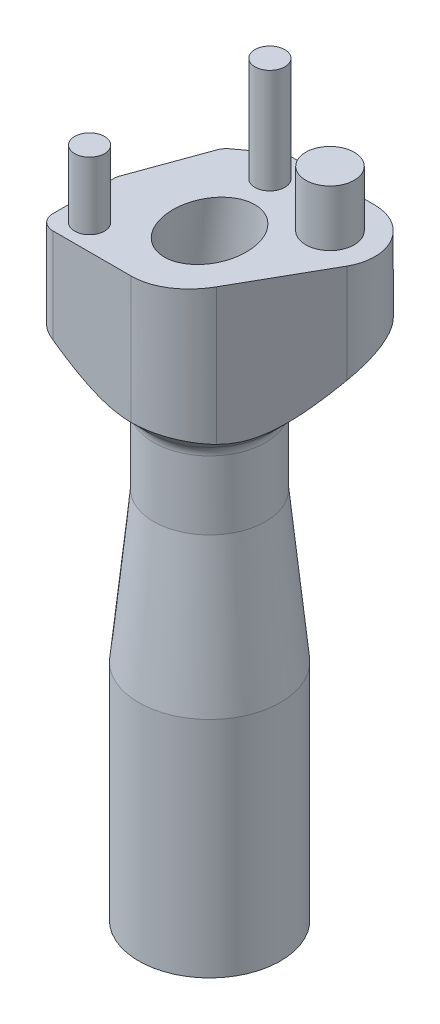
ISO-10303-21;
HEADER;
FILE_DESCRIPTION(('STEP AP214'),'2;1');
FILE_NAME('part.step','',(''),(''),'','','');
FILE_SCHEMA(('AUTOMOTIVE_DESIGN { 1 0 10303 214 1 1 1 1 }'));
ENDSEC;
DATA;
#1=APPLICATION_CONTEXT('core data for automotive mechanical design processes');
#2=APPLICATION_PROTOCOL_DEFINITION('international standard','automotive_design',2000,#1);
#3=PRODUCT_CONTEXT('',#1,'mechanical');
#4=PRODUCT('Part','Part','',(#3));
#5=PRODUCT_RELATED_PRODUCT_CATEGORY('part','',(#4));
#6=PRODUCT_DEFINITION_FORMATION('','',#4);
#7=PRODUCT_DEFINITION_CONTEXT('part definition',#1,'design');
#8=PRODUCT_DEFINITION('design','',#6,#7);
#9=PRODUCT_DEFINITION_SHAPE('','',#8);
#10=(LENGTH_UNIT() NAMED_UNIT(*) SI_UNIT(.MILLI.,.METRE.));
#11=(NAMED_UNIT(*) PLANE_ANGLE_UNIT() SI_UNIT($,.RADIAN.));
#12=(NAMED_UNIT(*) SI_UNIT($,.STERADIAN.) SOLID_ANGLE_UNIT());
#13=UNCERTAINTY_MEASURE_WITH_UNIT(LENGTH_MEASURE(1.E-05),#10,'distance_accuracy_value','');
#14=(GEOMETRIC_REPRESENTATION_CONTEXT(3) GLOBAL_UNCERTAINTY_ASSIGNED_CONTEXT((#13)) GLOBAL_UNIT_ASSIGNED_CONTEXT((#10,
#11,#12)) REPRESENTATION_CONTEXT('',''));
#15=CARTESIAN_POINT('',(0.,0.,0.));
#16=DIRECTION('',(0.,0.,1.));
#17=DIRECTION('',(1.,0.,0.));
#18=AXIS2_PLACEMENT_3D('',#15,#16,#17);
#19=CARTESIAN_POINT('',(-9.,94.,7.07894737));
#20=DIRECTION('',(0.,-1.,0.));
#21=DIRECTION('',(0.,0.,-1.));
#22=AXIS2_PLACEMENT_3D('',#19,#20,#21);
#23=CYLINDRICAL_SURFACE('',#22,2.);
#24=CARTESIAN_POINT('',(-9.,80.,7.07894737));
#25=DIRECTION('',(0.,1.,0.));
#26=DIRECTION('',(0.,0.,1.));
#27=AXIS2_PLACEMENT_3D('',#24,#25,#26);
#28=CIRCLE('',#27,2.);
#29=CARTESIAN_POINT('',(-9.,80.,9.07894737));
#30=VERTEX_POINT('',#29);
#31=EDGE_CURVE('E380',#30,#30,#28,.T.);
#32=ORIENTED_EDGE('',*,*,#31,.T.);
#33=EDGE_LOOP('',(#32));
#34=FACE_BOUND('',#33,.T.);
#35=CARTESIAN_POINT('',(-9.,89.,7.07894737));
#36=DIRECTION('',(0.,1.,0.));
#37=DIRECTION('',(0.,0.,1.));
#38=AXIS2_PLACEMENT_3D('',#35,#36,#37);
#39=CIRCLE('',#38,2.);
#40=CARTESIAN_POINT('',(-9.,89.,9.07894737));
#41=VERTEX_POINT('',#40);
#42=EDGE_CURVE('E13',#41,#41,#39,.T.);
#43=ORIENTED_EDGE('',*,*,#42,.F.);
#44=EDGE_LOOP('',(#43));
#45=FACE_BOUND('',#44,.T.);
#46=ADVANCED_FACE('F55',(#34,#45),#23,.T.);
#47=CARTESIAN_POINT('',(0.,80.,0.));
#48=DIRECTION('',(0.,1.,0.));
#49=DIRECTION('',(0.,0.,1.));
#50=AXIS2_PLACEMENT_3D('',#47,#48,#49);
#51=PLANE('',#50);
#52=CARTESIAN_POINT('',(-2.,80.,-10.07894737));
#53=DIRECTION('',(0.,1.,0.));
#54=DIRECTION('',(0.,0.,1.));
#55=AXIS2_PLACEMENT_3D('',#52,#53,#54);
#56=CIRCLE('',#55,2.);
#57=CARTESIAN_POINT('',(-2.,80.,-8.07894737));
#58=VERTEX_POINT('',#57);
#59=EDGE_CURVE('E678',#58,#58,#56,.T.);
#60=ORIENTED_EDGE('',*,*,#59,.F.);
#61=EDGE_LOOP('',(#60));
#62=FACE_BOUND('',#61,.T.);
#63=DIRECTION('',(0.341408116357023,0.,-0.939915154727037));
#64=VECTOR('',#63,1.);
#65=CARTESIAN_POINT('',(-12.5,80.,0.));
#66=LINE('',#65,#64);
#67=CARTESIAN_POINT('',(-12.3798303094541,80.,-0.330833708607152));
#68=VERTEX_POINT('',#67);
#69=CARTESIAN_POINT('',(-8.8928771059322,80.,-9.93060595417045));
#70=VERTEX_POINT('',#69);
#71=EDGE_CURVE('E166',#68,#70,#66,.T.);
#72=ORIENTED_EDGE('',*,*,#71,.F.);
#73=CARTESIAN_POINT('',(-10.5,80.,0.351982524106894));
#74=DIRECTION('',(0.,1.,0.));
#75=DIRECTION('',(0.,0.,1.));
#76=AXIS2_PLACEMENT_3D('',#73,#74,#75);
#77=CIRCLE('',#76,2.);
#78=CARTESIAN_POINT('',(-12.5,80.,0.351982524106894));
#79=VERTEX_POINT('',#78);
#80=EDGE_CURVE('E610',#68,#79,#77,.T.);
#81=ORIENTED_EDGE('',*,*,#80,.T.);
#82=DIRECTION('',(0.,0.,-1.));
#83=VECTOR('',#82,1.);
#84=CARTESIAN_POINT('',(-12.5,80.,10.5));
#85=LINE('',#84,#83);
#86=CARTESIAN_POINT('',(-12.5,80.,8.49999999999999));
#87=VERTEX_POINT('',#86);
#88=EDGE_CURVE('E171',#87,#79,#85,.T.);
#89=ORIENTED_EDGE('',*,*,#88,.F.);
#90=CARTESIAN_POINT('',(-10.5,80.,8.49999999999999));
#91=DIRECTION('',(0.,1.,0.));
#92=DIRECTION('',(0.,0.,1.));
#93=AXIS2_PLACEMENT_3D('',#90,#91,#92);
#94=CIRCLE('',#93,2.);
#95=CARTESIAN_POINT('',(-10.5,80.,10.5));
#96=VERTEX_POINT('',#95);
#97=EDGE_CURVE('E71',#87,#96,#94,.T.);
#98=ORIENTED_EDGE('',*,*,#97,.T.);
#99=DIRECTION('',(1.,0.,0.));
#100=VECTOR('',#99,1.);
#101=CARTESIAN_POINT('',(-12.5,80.,10.5));
#102=LINE('',#101,#100);
#103=CARTESIAN_POINT('',(0.,80.,10.5));
#104=VERTEX_POINT('',#103);
#105=EDGE_CURVE('E390',#96,#104,#102,.T.);
#106=ORIENTED_EDGE('',*,*,#105,.T.);
#107=CARTESIAN_POINT('',(0.,80.,0.));
#108=DIRECTION('',(0.,1.,0.));
#109=DIRECTION('',(0.,0.,1.));
#110=AXIS2_PLACEMENT_3D('',#107,#108,#109);
#111=ELLIPSE('',#110,10.5,8.5);
#112=CARTESIAN_POINT('',(6.95740145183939,80.,6.03205198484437));
#113=VERTEX_POINT('',#112);
#114=EDGE_CURVE('E387',#104,#113,#111,.T.);
#115=ORIENTED_EDGE('',*,*,#114,.T.);
#116=DIRECTION('',(-0.494000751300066,0.,0.869461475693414));
#117=VECTOR('',#116,1.);
#118=CARTESIAN_POINT('',(13.2842724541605,80.,-5.1034990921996));
#119=LINE('',#118,#117);
#120=CARTESIAN_POINT('',(13.2842724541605,80.,-5.1034990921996));
#121=VERTEX_POINT('',#120);
#122=EDGE_CURVE('E384',#121,#113,#119,.T.);
#123=ORIENTED_EDGE('',*,*,#122,.F.);
#124=CARTESIAN_POINT('',(8.0675036,80.,-8.0675036));
#125=DIRECTION('',(0.,-1.,0.));
#126=DIRECTION('',(0.,0.,-1.));
#127=AXIS2_PLACEMENT_3D('',#124,#125,#126);
#128=CIRCLE('',#127,6.00000000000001);
#129=CARTESIAN_POINT('',(8.06750360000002,80.,-14.0675036));
#130=VERTEX_POINT('',#129);
#131=EDGE_CURVE('E158',#130,#121,#128,.T.);
#132=ORIENTED_EDGE('',*,*,#131,.F.);
#133=DIRECTION('',(-1.,0.,0.));
#134=VECTOR('',#133,1.);
#135=CARTESIAN_POINT('',(8.06750360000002,80.,-14.0675036));
#136=LINE('',#135,#134);
#137=CARTESIAN_POINT('',(-3.83562109,80.,-14.0675036));
#138=VERTEX_POINT('',#137);
#139=EDGE_CURVE('E148',#130,#138,#136,.T.);
#140=ORIENTED_EDGE('',*,*,#139,.T.);
#141=DIRECTION('',(0.80557106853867,0.,-0.592499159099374));
#142=VECTOR('',#141,1.);
#143=CARTESIAN_POINT('',(-8.68605445,80.,-10.5));
#144=LINE('',#143,#142);
#145=CARTESIAN_POINT('',(-8.19804511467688,80.,-10.8589318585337));
#146=VERTEX_POINT('',#145);
#147=EDGE_CURVE('E141',#146,#138,#144,.T.);
#148=ORIENTED_EDGE('',*,*,#147,.F.);
#149=CARTESIAN_POINT('',(-7.01304679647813,80.,-9.2477897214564));
#150=DIRECTION('',(0.,1.,0.));
#151=DIRECTION('',(0.,0.,1.));
#152=AXIS2_PLACEMENT_3D('',#149,#150,#151);
#153=CIRCLE('',#152,2.);
#154=EDGE_CURVE('E607',#146,#70,#153,.T.);
#155=ORIENTED_EDGE('',*,*,#154,.T.);
#156=EDGE_LOOP('',(#72,#81,#89,#98,#106,#115,#123,#132,#140,#148,#155));
#157=FACE_BOUND('',#156,.T.);
#158=CARTESIAN_POINT('',(0.,80.,0.));
#159=DIRECTION('',(0.,1.,0.));
#160=DIRECTION('',(0.,0.,-1.));
#161=AXIS2_PLACEMENT_3D('',#158,#159,#160);
#162=ELLIPSE('',#161,6.07894736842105,4.92105263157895);
#163=CARTESIAN_POINT('',(0.,80.,-6.07894736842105));
#164=VERTEX_POINT('',#163);
#165=EDGE_CURVE('E149',#164,#164,#162,.T.);
#166=ORIENTED_EDGE('',*,*,#165,.F.);
#167=EDGE_LOOP('',(#166));
#168=FACE_BOUND('',#167,.T.);
#169=ORIENTED_EDGE('',*,*,#31,.F.);
#170=EDGE_LOOP('',(#169));
#171=FACE_BOUND('',#170,.T.);
#172=CARTESIAN_POINT('',(8.0675036,80.,-8.0675036));
#173=DIRECTION('',(0.,1.,0.));
#174=DIRECTION('',(0.,0.,1.));
#175=AXIS2_PLACEMENT_3D('',#172,#173,#174);
#176=CIRCLE('',#175,3.25);
#177=CARTESIAN_POINT('',(8.0675036,80.,-4.8175036));
#178=VERTEX_POINT('',#177);
#179=EDGE_CURVE('E679',#178,#178,#176,.T.);
#180=ORIENTED_EDGE('',*,*,#179,.F.);
#181=EDGE_LOOP('',(#180));
#182=FACE_BOUND('',#181,.T.);
#183=ADVANCED_FACE('F154',(#62,#157,#168,#171,#182),#51,.T.);
#184=CARTESIAN_POINT('',(0.,0.,0.));
#185=DIRECTION('',(0.,1.,0.));
#186=DIRECTION('',(0.,0.,1.));
#187=AXIS2_PLACEMENT_3D('',#184,#185,#186);
#188=PLANE('',#187);
#189=CARTESIAN_POINT('',(0.,0.,0.));
#190=DIRECTION('',(0.,1.,0.));
#191=DIRECTION('',(0.,0.,1.));
#192=AXIS2_PLACEMENT_3D('',#189,#190,#191);
#193=CIRCLE('',#192,7.1);
#194=CARTESIAN_POINT('',(0.,0.,7.1));
#195=VERTEX_POINT('',#194);
#196=EDGE_CURVE('E191',#195,#195,#193,.T.);
#197=ORIENTED_EDGE('',*,*,#196,.T.);
#198=EDGE_LOOP('',(#197));
#199=FACE_BOUND('',#198,.T.);
#200=CARTESIAN_POINT('',(0.,0.,0.));
#201=DIRECTION('',(0.,-1.,0.));
#202=DIRECTION('',(0.,0.,-1.));
#203=AXIS2_PLACEMENT_3D('',#200,#201,#202);
#204=CIRCLE('',#203,9.5);
#205=CARTESIAN_POINT('',(0.,0.,-9.5));
#206=VERTEX_POINT('',#205);
#207=EDGE_CURVE('E182',#206,#206,#204,.T.);
#208=ORIENTED_EDGE('',*,*,#207,.T.);
#209=EDGE_LOOP('',(#208));
#210=FACE_BOUND('',#209,.T.);
#211=ADVANCED_FACE('F226',(#199,#210),#188,.F.);
#212=CARTESIAN_POINT('',(0.,30.,0.));
#213=DIRECTION('',(0.,-1.,0.));
#214=DIRECTION('',(0.,0.,-1.));
#215=AXIS2_PLACEMENT_3D('',#212,#213,#214);
#216=CYLINDRICAL_SURFACE('',#215,7.1);
#217=CARTESIAN_POINT('',(0.,30.,0.));
#218=DIRECTION('',(0.,1.,0.));
#219=DIRECTION('',(0.,0.,1.));
#220=AXIS2_PLACEMENT_3D('',#217,#218,#219);
#221=CIRCLE('',#220,7.1);
#222=CARTESIAN_POINT('',(0.,30.,7.1));
#223=VERTEX_POINT('',#222);
#224=EDGE_CURVE('E188',#223,#223,#221,.T.);
#225=ORIENTED_EDGE('',*,*,#224,.T.);
#226=EDGE_LOOP('',(#225));
#227=FACE_BOUND('',#226,.T.);
#228=ORIENTED_EDGE('',*,*,#196,.F.);
#229=EDGE_LOOP('',(#228));
#230=FACE_BOUND('',#229,.T.);
#231=ADVANCED_FACE('F222',(#227,#230),#216,.F.);
#232=CARTESIAN_POINT('',(0.,30.,0.));
#233=DIRECTION('',(0.,1.,0.));
#234=DIRECTION('',(0.,0.,1.));
#235=AXIS2_PLACEMENT_3D('',#232,#233,#234);
#236=PLANE('',#235);
#237=ORIENTED_EDGE('',*,*,#224,.F.);
#238=EDGE_LOOP('',(#237));
#239=FACE_BOUND('',#238,.T.);
#240=CARTESIAN_POINT('',(0.,30.,0.));
#241=DIRECTION('',(0.,1.,0.));
#242=DIRECTION('',(0.,0.,1.));
#243=AXIS2_PLACEMENT_3D('',#240,#241,#242);
#244=CIRCLE('',#243,5.5);
#245=CARTESIAN_POINT('',(0.,30.,5.5));
#246=VERTEX_POINT('',#245);
#247=EDGE_CURVE('E185',#246,#246,#244,.T.);
#248=ORIENTED_EDGE('',*,*,#247,.T.);
#249=EDGE_LOOP('',(#248));
#250=FACE_BOUND('',#249,.T.);
#251=ADVANCED_FACE('F217',(#239,#250),#236,.F.);
#252=CARTESIAN_POINT('',(0.,50.,0.));
#253=DIRECTION('',(0.,-1.,0.));
#254=DIRECTION('',(0.,0.,-1.));
#255=AXIS2_PLACEMENT_3D('',#252,#253,#254);
#256=CYLINDRICAL_SURFACE('',#255,5.5);
#257=ORIENTED_EDGE('',*,*,#247,.F.);
#258=EDGE_LOOP('',(#257));
#259=FACE_BOUND('',#258,.T.);
#260=CARTESIAN_POINT('',(0.,70.,0.));
#261=DIRECTION('',(0.,-1.,0.));
#262=DIRECTION('',(0.,0.,-1.));
#263=AXIS2_PLACEMENT_3D('',#260,#261,#262);
#264=CIRCLE('',#263,5.5);
#265=CARTESIAN_POINT('',(0.,70.,-5.5));
#266=VERTEX_POINT('',#265);
#267=EDGE_CURVE('E199',#266,#266,#264,.T.);
#268=ORIENTED_EDGE('',*,*,#267,.F.);
#269=EDGE_LOOP('',(#268));
#270=FACE_BOUND('',#269,.T.);
#271=ADVANCED_FACE('F206',(#259,#270),#256,.F.);
#272=CARTESIAN_POINT('',(0.,30.,0.));
#273=DIRECTION('',(0.,-1.,0.));
#274=DIRECTION('',(0.,0.,-1.));
#275=AXIS2_PLACEMENT_3D('',#272,#273,#274);
#276=CYLINDRICAL_SURFACE('',#275,9.5);
#277=CARTESIAN_POINT('',(0.,30.,0.));
#278=DIRECTION('',(0.,-1.,0.));
#279=DIRECTION('',(0.,0.,-1.));
#280=AXIS2_PLACEMENT_3D('',#277,#278,#279);
#281=CIRCLE('',#280,9.5);
#282=CARTESIAN_POINT('',(0.,30.,-9.5));
#283=VERTEX_POINT('',#282);
#284=EDGE_CURVE('E178',#283,#283,#281,.T.);
#285=ORIENTED_EDGE('',*,*,#284,.T.);
#286=EDGE_LOOP('',(#285));
#287=FACE_BOUND('',#286,.T.);
#288=ORIENTED_EDGE('',*,*,#207,.F.);
#289=EDGE_LOOP('',(#288));
#290=FACE_BOUND('',#289,.T.);
#291=ADVANCED_FACE('F216',(#287,#290),#276,.T.);
#292=CARTESIAN_POINT('',(0.,30.,0.));
#293=DIRECTION('',(0.,-1.,0.));
#294=DIRECTION('',(0.,0.,-1.));
#295=AXIS2_PLACEMENT_3D('',#292,#293,#294);
#296=CONICAL_SURFACE('',#295,9.5,0.099668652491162);
#297=ORIENTED_EDGE('',*,*,#284,.F.);
#298=EDGE_LOOP('',(#297));
#299=FACE_BOUND('',#298,.T.);
#300=CARTESIAN_POINT('',(0.,50.,0.));
#301=DIRECTION('',(0.,1.,0.));
#302=DIRECTION('',(0.,0.,1.));
#303=AXIS2_PLACEMENT_3D('',#300,#301,#302);
#304=CIRCLE('',#303,7.5);
#305=CARTESIAN_POINT('',(0.,50.,7.5));
#306=VERTEX_POINT('',#305);
#307=EDGE_CURVE('E175',#306,#306,#304,.T.);
#308=ORIENTED_EDGE('',*,*,#307,.F.);
#309=EDGE_LOOP('',(#308));
#310=FACE_BOUND('',#309,.T.);
#311=ADVANCED_FACE('F414',(#299,#310),#296,.T.);
#312=CARTESIAN_POINT('',(0.,70.,0.));
#313=DIRECTION('',(0.,-1.,0.));
#314=DIRECTION('',(0.,0.,-1.));
#315=AXIS2_PLACEMENT_3D('',#312,#313,#314);
#316=CYLINDRICAL_SURFACE('',#315,7.5);
#317=CARTESIAN_POINT('',(0.,59.1715728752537,0.));
#318=DIRECTION('',(0.,-1.,0.));
#319=DIRECTION('',(0.,0.,-1.));
#320=AXIS2_PLACEMENT_3D('',#317,#318,#319);
#321=CIRCLE('',#320,7.5);
#322=CARTESIAN_POINT('',(0.,59.1715728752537,-7.5));
#323=VERTEX_POINT('',#322);
#324=EDGE_CURVE('E624',#323,#323,#321,.T.);
#325=ORIENTED_EDGE('',*,*,#324,.T.);
#326=EDGE_LOOP('',(#325));
#327=FACE_BOUND('',#326,.T.);
#328=ORIENTED_EDGE('',*,*,#307,.T.);
#329=EDGE_LOOP('',(#328));
#330=FACE_BOUND('',#329,.T.);
#331=ADVANCED_FACE('F408',(#327,#330),#316,.T.);
#332=CARTESIAN_POINT('',(8.06750360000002,80.,-14.0675036));
#333=DIRECTION('',(0.,0.,1.));
#334=DIRECTION('',(1.,0.,0.));
#335=AXIS2_PLACEMENT_3D('',#332,#333,#334);
#336=PLANE('',#335);
#337=DIRECTION('',(0.,-1.,0.));
#338=VECTOR('',#337,1.);
#339=CARTESIAN_POINT('',(8.06750360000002,80.,-14.0675036));
#340=LINE('',#339,#338);
#341=CARTESIAN_POINT('',(8.06750360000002,68.716635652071,-14.0675036));
#342=VERTEX_POINT('',#341);
#343=EDGE_CURVE('E165',#130,#342,#340,.T.);
#344=ORIENTED_EDGE('',*,*,#343,.T.);
#345=CARTESIAN_POINT('',(8.06750360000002,68.716635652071,-14.0675036));
#346=CARTESIAN_POINT('',(7.785797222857,68.5765159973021,-14.0675036));
#347=CARTESIAN_POINT('',(7.50185938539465,68.4407617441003,-14.0675036));
#348=CARTESIAN_POINT('',(6.9291714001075,68.1793786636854,-14.0675036));
#349=CARTESIAN_POINT('',(6.64041856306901,68.0537557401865,-14.0675036));
#350=CARTESIAN_POINT('',(6.05636091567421,67.813489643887,-14.0675036));
#351=CARTESIAN_POINT('',(5.76102752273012,67.6989155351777,-14.0675036));
#352=CARTESIAN_POINT('',(5.16548699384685,67.4833201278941,-14.0675036));
#353=CARTESIAN_POINT('',(4.86528072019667,67.3822964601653,-14.0675036));
#354=CARTESIAN_POINT('',(4.27355314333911,67.1997377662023,-14.0675036));
#355=CARTESIAN_POINT('',(3.98223845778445,67.1175363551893,-14.0675036));
#356=CARTESIAN_POINT('',(3.39565587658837,66.9687482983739,-14.0675036));
#357=CARTESIAN_POINT('',(3.10038840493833,66.902159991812,-14.0675036));
#358=CARTESIAN_POINT('',(2.50721779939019,66.786232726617,-14.0675036));
#359=CARTESIAN_POINT('',(2.20932299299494,66.736851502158,-14.0675036));
#360=CARTESIAN_POINT('',(1.61111974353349,66.6563591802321,-14.0675036));
#361=CARTESIAN_POINT('',(1.31081170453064,66.6252450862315,-14.0675036));
#362=CARTESIAN_POINT('',(0.60936977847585,66.5750389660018,-14.0675036));
#363=CARTESIAN_POINT('',(0.207684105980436,66.5633082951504,-14.0675036));
#364=CARTESIAN_POINT('',(-0.595522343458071,66.5743719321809,-14.0675036));
#365=CARTESIAN_POINT('',(-0.997042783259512,66.5971915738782,-14.0675036));
#366=CARTESIAN_POINT('',(-1.6027227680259,66.6570205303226,-14.0675036));
#367=CARTESIAN_POINT('',(-1.80817264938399,66.6817834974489,-14.0675036));
#368=CARTESIAN_POINT('',(-2.21788948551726,66.7398245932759,-14.0675036));
#369=CARTESIAN_POINT('',(-2.42215636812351,66.7731032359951,-14.0675036));
#370=CARTESIAN_POINT('',(-2.82898861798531,66.8477484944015,-14.0675036));
#371=CARTESIAN_POINT('',(-3.03155545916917,66.8891071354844,-14.0675036));
#372=CARTESIAN_POINT('',(-3.4349416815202,66.9794608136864,-14.0675036));
#373=CARTESIAN_POINT('',(-3.63576138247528,67.0284544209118,-14.0675036));
#374=CARTESIAN_POINT('',(-3.83562109,67.0810372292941,-14.0675036));
#375=B_SPLINE_CURVE_WITH_KNOTS('',3,(#345,#346,#347,#348,#349,#350,#351,#352,#353,#354,#355,
#356,#357,#358,#359,#360,#361,#362,#363,#364,#365,#366,#367,#368,#369,#370,#371,#372,#373,#374),
.UNSPECIFIED.,.F.,.F.,(4,2,2,2,2,2,2,2,2,2,2,2,2,2,4),(0.,0.943931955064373,1.88841004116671,
2.83845377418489,3.78833118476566,4.69601207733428,5.60359637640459,6.50893539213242,
7.41412585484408,8.61818895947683,9.82313536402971,10.4437953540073,11.0644928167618,
11.684580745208,12.3045526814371),.UNSPECIFIED.);
#376=CARTESIAN_POINT('',(-3.83562109,67.0810372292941,-14.0675036));
#377=VERTEX_POINT('',#376);
#378=EDGE_CURVE('E163',#342,#377,#375,.T.);
#379=ORIENTED_EDGE('',*,*,#378,.T.);
#380=DIRECTION('',(0.,-1.,0.));
#381=VECTOR('',#380,1.);
#382=CARTESIAN_POINT('',(-3.83562109,80.,-14.0675036));
#383=LINE('',#382,#381);
#384=EDGE_CURVE('E145',#138,#377,#383,.T.);
#385=ORIENTED_EDGE('',*,*,#384,.F.);
#386=ORIENTED_EDGE('',*,*,#139,.F.);
#387=EDGE_LOOP('',(#344,#379,#385,#386));
#388=FACE_BOUND('',#387,.T.);
#389=ADVANCED_FACE('F161',(#388),#336,.F.);
#390=CARTESIAN_POINT('',(8.0675036,80.,-8.0675036));
#391=DIRECTION('',(0.,-1.,0.));
#392=DIRECTION('',(0.,0.,-1.));
#393=AXIS2_PLACEMENT_3D('',#390,#391,#392);
#394=CYLINDRICAL_SURFACE('',#393,6.00000000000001);
#395=DIRECTION('',(0.,-1.,0.));
#396=VECTOR('',#395,1.);
#397=CARTESIAN_POINT('',(13.2842724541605,80.,-5.1034990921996));
#398=LINE('',#397,#396);
#399=CARTESIAN_POINT('',(13.2842724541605,66.7308677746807,-5.1034990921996));
#400=VERTEX_POINT('',#399);
#401=EDGE_CURVE('E168',#121,#400,#398,.T.);
#402=ORIENTED_EDGE('',*,*,#401,.T.);
#403=CARTESIAN_POINT('',(13.2842724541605,66.7308677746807,-5.1034990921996));
#404=CARTESIAN_POINT('',(13.3838448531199,66.8866751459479,-5.2787313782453));
#405=CARTESIAN_POINT('',(13.4757601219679,67.039582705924,-5.46108990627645));
#406=CARTESIAN_POINT('',(13.6422847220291,67.3387879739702,-5.83936620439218));
#407=CARTESIAN_POINT('',(13.716856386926,67.4850707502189,-6.0353123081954));
#408=CARTESIAN_POINT('',(13.8466361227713,67.7703742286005,-6.44049756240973));
#409=CARTESIAN_POINT('',(13.9017274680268,67.9093470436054,-6.64980825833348));
#410=CARTESIAN_POINT('',(13.9895352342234,68.1776104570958,-7.07886216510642));
#411=CARTESIAN_POINT('',(14.022274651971,68.3069108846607,-7.29859440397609));
#412=CARTESIAN_POINT('',(14.0566195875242,68.5149676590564,-7.67508996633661));
#413=CARTESIAN_POINT('',(14.0648187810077,68.5967098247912,-7.82962857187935));
#414=CARTESIAN_POINT('',(14.0690726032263,68.754493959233,-8.14173773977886));
#415=CARTESIAN_POINT('',(14.0651303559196,68.8305373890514,-8.29930751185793));
#416=CARTESIAN_POINT('',(14.044470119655,68.9762093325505,-8.61615853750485));
#417=CARTESIAN_POINT('',(14.0277799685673,69.0458514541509,-8.7754353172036));
#418=CARTESIAN_POINT('',(13.9811034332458,69.1782865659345,-9.09481363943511));
#419=CARTESIAN_POINT('',(13.9511235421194,69.2410828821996,-9.25491474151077));
#420=CARTESIAN_POINT('',(13.8771045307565,69.3597847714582,-9.57612429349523));
#421=CARTESIAN_POINT('',(13.8329437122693,69.4156246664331,-9.73722916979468));
#422=CARTESIAN_POINT('',(13.7303954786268,69.5191237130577,-10.0574539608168));
#423=CARTESIAN_POINT('',(13.6720150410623,69.5667868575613,-10.2165748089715));
#424=CARTESIAN_POINT('',(13.5409515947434,69.6533981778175,-10.5313289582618));
#425=CARTESIAN_POINT('',(13.4682648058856,69.6923440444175,-10.6869613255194));
#426=CARTESIAN_POINT('',(13.3088212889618,69.7609817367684,-10.9929675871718));
#427=CARTESIAN_POINT('',(13.2220667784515,69.7906750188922,-11.1433423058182));
#428=CARTESIAN_POINT('',(13.0467864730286,69.8372607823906,-11.41861135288));
#429=CARTESIAN_POINT('',(12.9598558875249,69.8552935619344,-11.5443316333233));
#430=CARTESIAN_POINT('',(12.7761862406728,69.8837625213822,-11.7892954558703));
#431=CARTESIAN_POINT('',(12.6794481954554,69.8941994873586,-11.9085396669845));
#432=CARTESIAN_POINT('',(12.4769282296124,69.907350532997,-12.139425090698));
#433=CARTESIAN_POINT('',(12.3711511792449,69.9100687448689,-12.2510703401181));
#434=CARTESIAN_POINT('',(12.1513774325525,69.9077612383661,-12.4658646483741));
#435=CARTESIAN_POINT('',(12.0373810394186,69.902735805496,-12.5690140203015));
#436=CARTESIAN_POINT('',(11.8111576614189,69.8856809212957,-12.758466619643));
#437=CARTESIAN_POINT('',(11.6994600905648,69.8742155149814,-12.8454547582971));
#438=CARTESIAN_POINT('',(11.4707252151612,69.8448428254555,-13.0109859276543));
#439=CARTESIAN_POINT('',(11.3536862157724,69.8269334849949,-13.0895262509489));
#440=CARTESIAN_POINT('',(11.1152525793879,69.7848564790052,-13.2376990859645));
#441=CARTESIAN_POINT('',(10.9938597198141,69.7606913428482,-13.3073351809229));
#442=CARTESIAN_POINT('',(10.7475421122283,69.7063143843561,-13.4374947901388));
#443=CARTESIAN_POINT('',(10.622616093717,69.6761003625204,-13.4980149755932));
#444=CARTESIAN_POINT('',(10.3674607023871,69.6091833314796,-13.6109754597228));
#445=CARTESIAN_POINT('',(10.2371750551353,69.5723547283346,-13.6632139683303));
#446=CARTESIAN_POINT('',(9.97478060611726,69.4929677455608,-13.7580012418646));
#447=CARTESIAN_POINT('',(9.84267106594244,69.4504069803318,-13.8005459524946));
#448=CARTESIAN_POINT('',(9.57757933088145,69.3599089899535,-13.8760026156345));
#449=CARTESIAN_POINT('',(9.44459727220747,69.3119725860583,-13.9089160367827));
#450=CARTESIAN_POINT('',(9.17853875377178,69.2110578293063,-13.9653081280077));
#451=CARTESIAN_POINT('',(9.04546228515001,69.1580789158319,-13.9887857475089));
#452=CARTESIAN_POINT('',(8.77035186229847,69.0434192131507,-14.0279292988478));
#453=CARTESIAN_POINT('',(8.62836726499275,68.9813860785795,-14.0429062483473));
#454=CARTESIAN_POINT('',(8.34636849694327,68.8525270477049,-14.0626838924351));
#455=CARTESIAN_POINT('',(8.20634978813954,68.7857156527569,-14.0675141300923));
#456=CARTESIAN_POINT('',(8.06750360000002,68.716635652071,-14.0675036));
#457=B_SPLINE_CURVE_WITH_KNOTS('',3,(#403,#404,#405,#406,#407,#408,#409,#410,#411,#412,#413,
#414,#415,#416,#417,#418,#419,#420,#421,#422,#423,#424,#425,#426,#427,#428,#429,#430,#431,#432,
#433,#434,#435,#436,#437,#438,#439,#440,#441,#442,#443,#444,#445,#446,#447,#448,#449,#450,#451,
#452,#453,#454,#455,#456),.UNSPECIFIED.,.F.,.F.,(4,2,2,2,2,2,2,2,2,2,2,2,2,2,2,2,2,2,2,2,2,2,2,
2,2,2,4),(0.,0.76422269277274,1.53008991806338,2.30047139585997,3.07005906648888,
3.59463119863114,4.11906837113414,4.64236358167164,5.16540340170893,5.69305751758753,
6.22045323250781,6.74798848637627,7.27544066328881,7.73655195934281,8.19761552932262,
8.65843222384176,9.11923192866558,9.54484997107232,9.97060401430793,10.3961861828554,
10.821923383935,11.2568178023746,11.6918937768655,12.1269033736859,12.5619613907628,
13.0285312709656,13.4937407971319),.UNSPECIFIED.);
#458=EDGE_CURVE('E264',#400,#342,#457,.T.);
#459=ORIENTED_EDGE('',*,*,#458,.T.);
#460=ORIENTED_EDGE('',*,*,#343,.F.);
#461=ORIENTED_EDGE('',*,*,#131,.T.);
#462=EDGE_LOOP('',(#402,#459,#460,#461));
#463=FACE_BOUND('',#462,.T.);
#464=ADVANCED_FACE('F401',(#463),#394,.T.);
#465=CARTESIAN_POINT('',(13.2842724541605,80.,-5.1034990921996));
#466=DIRECTION('',(0.869461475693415,0.,0.494000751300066));
#467=DIRECTION('',(0.494000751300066,0.,-0.869461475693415));
#468=AXIS2_PLACEMENT_3D('',#465,#466,#467);
#469=PLANE('',#468);
#470=DIRECTION('',(0.,-1.,0.));
#471=VECTOR('',#470,1.);
#472=CARTESIAN_POINT('',(6.95740145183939,80.,6.03205198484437));
#473=LINE('',#472,#471);
#474=CARTESIAN_POINT('',(6.95740145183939,61.7082075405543,6.03205198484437));
#475=VERTEX_POINT('',#474);
#476=EDGE_CURVE('E639',#113,#475,#473,.T.);
#477=ORIENTED_EDGE('',*,*,#476,.T.);
#478=CARTESIAN_POINT('',(6.95740145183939,61.7082075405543,6.03205198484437));
#479=CARTESIAN_POINT('',(7.01313025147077,61.6860589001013,5.93396702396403));
#480=CARTESIAN_POINT('',(7.06904278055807,61.665836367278,5.83555869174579));
#481=CARTESIAN_POINT('',(7.18119055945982,61.6294005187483,5.63817402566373));
#482=CARTESIAN_POINT('',(7.23742583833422,61.6131875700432,5.5391976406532));
#483=CARTESIAN_POINT('',(7.40651299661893,61.5708093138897,5.24159734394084));
#484=CARTESIAN_POINT('',(7.51976633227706,61.5508964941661,5.04226685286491));
#485=CARTESIAN_POINT('',(7.74475125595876,61.5287468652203,4.64628420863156));
#486=CARTESIAN_POINT('',(7.85647584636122,61.5262143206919,4.44964437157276));
#487=CARTESIAN_POINT('',(8.07969251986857,61.5381321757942,4.05677391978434));
#488=CARTESIAN_POINT('',(8.19118462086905,61.5525812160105,3.86054327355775));
#489=CARTESIAN_POINT('',(8.42937575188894,61.6011830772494,3.44131716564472));
#490=CARTESIAN_POINT('',(8.55594835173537,61.6378775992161,3.21854422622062));
#491=CARTESIAN_POINT('',(8.80730439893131,61.7310873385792,2.77614732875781));
#492=CARTESIAN_POINT('',(8.93208738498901,61.7876075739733,2.55652418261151));
#493=CARTESIAN_POINT('',(9.1809115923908,61.9190049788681,2.11858342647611));
#494=CARTESIAN_POINT('',(9.30492415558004,61.9941022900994,1.9003162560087));
#495=CARTESIAN_POINT('',(9.55034796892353,62.1597294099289,1.46836033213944));
#496=CARTESIAN_POINT('',(9.67175980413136,62.2502557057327,1.2546705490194));
#497=CARTESIAN_POINT('',(9.95476300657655,62.4788891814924,0.756573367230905));
#498=CARTESIAN_POINT('',(10.1152729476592,62.6224629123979,0.474069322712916));
#499=CARTESIAN_POINT('',(10.4318921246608,62.9284197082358,-0.0831933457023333));
#500=CARTESIAN_POINT('',(10.5879990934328,63.0908122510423,-0.357947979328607));
#501=CARTESIAN_POINT('',(10.8967438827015,63.4308051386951,-0.901351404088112));
#502=CARTESIAN_POINT('',(11.0493688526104,63.608452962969,-1.16997757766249));
#503=CARTESIAN_POINT('',(11.3511352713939,63.9752948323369,-1.70109878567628));
#504=CARTESIAN_POINT('',(11.5002773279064,64.1644868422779,-1.96359488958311));
#505=CARTESIAN_POINT('',(11.7892857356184,64.5437495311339,-2.4722614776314));
#506=CARTESIAN_POINT('',(11.9292758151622,64.7334357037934,-2.71864972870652));
#507=CARTESIAN_POINT('',(12.2069486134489,65.1196321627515,-3.20736518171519));
#508=CARTESIAN_POINT('',(12.3446311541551,65.3161429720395,-3.44969207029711));
#509=CARTESIAN_POINT('',(12.616939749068,65.7131601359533,-3.92896630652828));
#510=CARTESIAN_POINT('',(12.7515813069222,65.9136230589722,-4.16594094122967));
#511=CARTESIAN_POINT('',(13.0191429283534,66.3190693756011,-4.63686031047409));
#512=CARTESIAN_POINT('',(13.1520634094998,66.5240516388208,-4.87080577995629));
#513=CARTESIAN_POINT('',(13.2842724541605,66.7308677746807,-5.10349909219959));
#514=B_SPLINE_CURVE_WITH_KNOTS('',3,(#478,#479,#480,#481,#482,#483,#484,#485,#486,#487,#488,
#489,#490,#491,#492,#493,#494,#495,#496,#497,#498,#499,#500,#501,#502,#503,#504,#505,#506,#507,
#508,#509,#510,#511,#512,#513),.UNSPECIFIED.,.F.,.F.,(4,2,2,2,2,2,2,2,2,2,2,2,2,2,2,2,2,4),(0.,
0.344862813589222,0.689757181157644,1.37942154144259,2.05732111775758,2.73516643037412,
3.51079472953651,4.28661948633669,5.07211968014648,5.85744127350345,6.9223049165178,
7.98770721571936,9.05655471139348,10.1252143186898,11.148114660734,12.1710935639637,
13.1860482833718,14.2007519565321),.UNSPECIFIED.);
#515=EDGE_CURVE('E257',#475,#400,#514,.T.);
#516=ORIENTED_EDGE('',*,*,#515,.T.);
#517=ORIENTED_EDGE('',*,*,#401,.F.);
#518=ORIENTED_EDGE('',*,*,#122,.T.);
#519=EDGE_LOOP('',(#477,#516,#517,#518));
#520=FACE_BOUND('',#519,.T.);
#521=ADVANCED_FACE('F396',(#520),#469,.T.);
#522=DIRECTION('',(0.,-1.,0.));
#523=VECTOR('',#522,1.);
#524=SURFACE_OF_LINEAR_EXTRUSION('',#111,#523);
#525=DIRECTION('',(0.,-1.,0.));
#526=VECTOR('',#525,1.);
#527=CARTESIAN_POINT('',(0.,80.,10.5));
#528=LINE('',#527,#526);
#529=CARTESIAN_POINT('',(0.,62.9999999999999,10.5));
#530=VERTEX_POINT('',#529);
#531=EDGE_CURVE('E179',#104,#530,#528,.T.);
#532=ORIENTED_EDGE('',*,*,#531,.T.);
#533=CARTESIAN_POINT('',(0.,62.9999999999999,10.5));
#534=CARTESIAN_POINT('',(0.0964544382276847,63.0000008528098,10.5000012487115));
#535=CARTESIAN_POINT('',(0.192895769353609,62.9993007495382,10.4979714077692));
#536=CARTESIAN_POINT('',(0.385583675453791,62.9965082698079,10.4898669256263));
#537=CARTESIAN_POINT('',(0.481830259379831,62.9944159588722,10.4837924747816));
#538=CARTESIAN_POINT('',(0.769888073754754,62.9860694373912,10.4595406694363));
#539=CARTESIAN_POINT('',(0.961169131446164,62.9777456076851,10.4353348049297));
#540=CARTESIAN_POINT('',(1.33944277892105,62.9558693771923,10.371477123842));
#541=CARTESIAN_POINT('',(1.52645574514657,62.9423531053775,10.3319320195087));
#542=CARTESIAN_POINT('',(1.89630959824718,62.9104238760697,10.2380214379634));
#543=CARTESIAN_POINT('',(2.07915006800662,62.892010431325,10.1836544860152));
#544=CARTESIAN_POINT('',(2.43911910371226,62.8507672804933,10.0610502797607));
#545=CARTESIAN_POINT('',(2.61625971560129,62.8279477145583,9.99284485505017));
#546=CARTESIAN_POINT('',(2.96442770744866,62.7783553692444,9.8433759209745));
#547=CARTESIAN_POINT('',(3.13545290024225,62.7515811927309,9.76210779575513));
#548=CARTESIAN_POINT('',(3.47091126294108,62.69457603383,9.58734434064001));
#549=CARTESIAN_POINT('',(3.63533241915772,62.6643391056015,9.49382793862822));
#550=CARTESIAN_POINT('',(3.95675310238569,62.6010076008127,9.29565088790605));
#551=CARTESIAN_POINT('',(4.11375105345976,62.567912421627,9.19098788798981));
#552=CARTESIAN_POINT('',(4.47657001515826,62.4867621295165,8.9308505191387));
#553=CARTESIAN_POINT('',(4.67897679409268,62.4377005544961,8.77089867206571));
#554=CARTESIAN_POINT('',(5.06847342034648,62.3367242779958,8.43419045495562));
#555=CARTESIAN_POINT('',(5.25555670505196,62.2848083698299,8.25742695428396));
#556=CARTESIAN_POINT('',(5.79336214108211,62.126841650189,7.70491612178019));
#557=CARTESIAN_POINT('',(6.12094316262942,62.0185002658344,7.30672590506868));
#558=CARTESIAN_POINT('',(6.51360456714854,61.8777192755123,6.7484786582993));
#559=CARTESIAN_POINT('',(6.60726628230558,61.8431552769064,6.60802650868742));
#560=CARTESIAN_POINT('',(6.78750741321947,61.7749485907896,6.32309216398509));
#561=CARTESIAN_POINT('',(6.87410875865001,61.7413032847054,6.17862447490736));
#562=CARTESIAN_POINT('',(6.95740145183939,61.7082075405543,6.03205198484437));
#563=B_SPLINE_CURVE_WITH_KNOTS('',3,(#533,#534,#535,#536,#537,#538,#539,#540,#541,#542,#543,
#544,#545,#546,#547,#548,#549,#550,#551,#552,#553,#554,#555,#556,#557,#558,#559,#560,#561,#562),
.UNSPECIFIED.,.F.,.F.,(4,2,2,2,2,2,2,2,2,2,2,2,2,2,4),(0.,0.289313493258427,0.578613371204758,
1.15675945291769,1.73095360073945,2.30520490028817,2.87815005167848,3.45129810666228,
4.02544549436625,4.59971423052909,5.38634079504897,6.17330250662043,7.7460907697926,
8.26295074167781,8.77813878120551),.UNSPECIFIED.);
#564=EDGE_CURVE('E250',#530,#475,#563,.T.);
#565=ORIENTED_EDGE('',*,*,#564,.T.);
#566=ORIENTED_EDGE('',*,*,#476,.F.);
#567=ORIENTED_EDGE('',*,*,#114,.F.);
#568=EDGE_LOOP('',(#532,#565,#566,#567));
#569=FACE_BOUND('',#568,.T.);
#570=ADVANCED_FACE('F392',(#569),#524,.F.);
#571=CARTESIAN_POINT('',(-12.5,80.,10.5));
#572=DIRECTION('',(0.,0.,-1.));
#573=DIRECTION('',(-1.,0.,0.));
#574=AXIS2_PLACEMENT_3D('',#571,#572,#573);
#575=PLANE('',#574);
#576=ORIENTED_EDGE('',*,*,#105,.F.);
#577=DIRECTION('',(0.,-1.,0.));
#578=VECTOR('',#577,1.);
#579=CARTESIAN_POINT('',(-10.5,68.8248277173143,10.5));
#580=LINE('',#579,#578);
#581=CARTESIAN_POINT('',(-10.5,67.3492424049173,10.5));
#582=VERTEX_POINT('',#581);
#583=EDGE_CURVE('E64',#96,#582,#580,.T.);
#584=ORIENTED_EDGE('',*,*,#583,.T.);
#585=CARTESIAN_POINT('',(-12.5,68.8248277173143,10.5));
#586=CARTESIAN_POINT('',(-12.2681126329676,68.6472874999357,10.5));
#587=CARTESIAN_POINT('',(-12.0352494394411,68.471010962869,10.5));
#588=CARTESIAN_POINT('',(-11.5673058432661,68.1214029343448,10.5));
#589=CARTESIAN_POINT('',(-11.332225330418,67.948071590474,10.5));
#590=CARTESIAN_POINT('',(-10.859970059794,67.6050548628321,10.5));
#591=CARTESIAN_POINT('',(-10.6227991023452,67.435364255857,10.5));
#592=CARTESIAN_POINT('',(-10.1457072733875,67.0998834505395,10.5));
#593=CARTESIAN_POINT('',(-9.90578637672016,66.9340932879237,10.5));
#594=CARTESIAN_POINT('',(-9.42270138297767,66.6069375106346,10.5));
#595=CARTESIAN_POINT('',(-9.17953518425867,66.4455749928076,10.5));
#596=CARTESIAN_POINT('',(-8.6897661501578,66.1281793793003,10.5));
#597=CARTESIAN_POINT('',(-8.44316354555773,65.9721459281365,10.5));
#598=CARTESIAN_POINT('',(-7.94572532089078,65.6660912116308,10.5));
#599=CARTESIAN_POINT('',(-7.69488387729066,65.5160793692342,10.5));
#600=CARTESIAN_POINT('',(-7.18883191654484,65.2234815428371,10.5));
#601=CARTESIAN_POINT('',(-6.93362034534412,65.0808973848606,10.5));
#602=CARTESIAN_POINT('',(-6.67603529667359,64.9426463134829,10.5));
#603=B_SPLINE_CURVE_WITH_KNOTS('',3,(#585,#586,#587,#588,#589,#590,#591,#592,#593,#594,#595,
#596,#597,#598,#599,#600,#601,#602),.UNSPECIFIED.,.F.,.F.,(4,2,2,2,2,2,2,2,4),(0.,
0.876150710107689,1.75234519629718,2.62718485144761,3.5020325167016,4.3774772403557,
5.25286345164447,6.12956998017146,7.00649103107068),.UNSPECIFIED.);
#604=CARTESIAN_POINT('',(-6.67603529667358,64.9426463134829,10.5));
#605=VERTEX_POINT('',#604);
#606=EDGE_CURVE('E298',#582,#605,#603,.T.);
#607=ORIENTED_EDGE('',*,*,#606,.T.);
#608=CARTESIAN_POINT('',(-6.67603529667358,64.9426463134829,10.5));
#609=CARTESIAN_POINT('',(-6.48886194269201,64.8422335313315,10.5));
#610=CARTESIAN_POINT('',(-6.30043184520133,64.7441266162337,10.5));
#611=CARTESIAN_POINT('',(-5.92084189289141,64.5531887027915,10.5));
#612=CARTESIAN_POINT('',(-5.72968114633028,64.4603594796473,10.5));
#613=CARTESIAN_POINT('',(-5.34371023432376,64.2803228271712,10.5));
#614=CARTESIAN_POINT('',(-5.14888790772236,64.1931412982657,10.5));
#615=CARTESIAN_POINT('',(-4.75634196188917,64.0256781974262,10.5));
#616=CARTESIAN_POINT('',(-4.55861864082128,63.9453959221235,10.5));
#617=CARTESIAN_POINT('',(-3.97103109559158,63.7200960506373,10.5));
#618=CARTESIAN_POINT('',(-3.57684451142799,63.5859227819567,10.5));
#619=CARTESIAN_POINT('',(-2.97797443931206,63.4124643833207,10.5));
#620=CARTESIAN_POINT('',(-2.77724435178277,63.3593089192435,10.5));
#621=CARTESIAN_POINT('',(-2.37338871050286,63.2631104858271,10.5));
#622=CARTESIAN_POINT('',(-2.17026369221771,63.2200652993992,10.5));
#623=CARTESIAN_POINT('',(-1.80488506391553,63.1528155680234,10.5));
#624=CARTESIAN_POINT('',(-1.64300803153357,63.1265527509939,10.5));
#625=CARTESIAN_POINT('',(-1.31823506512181,63.0812043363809,10.5));
#626=CARTESIAN_POINT('',(-1.15533907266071,63.0621191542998,10.5));
#627=CARTESIAN_POINT('',(-0.827232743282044,63.0312586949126,10.5));
#628=CARTESIAN_POINT('',(-0.662015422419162,63.019557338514,10.5));
#629=CARTESIAN_POINT('',(-0.331200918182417,63.003917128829,10.5));
#630=CARTESIAN_POINT('',(-0.165603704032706,62.999978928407,10.5));
#631=CARTESIAN_POINT('',(0.,62.9999999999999,10.5));
#632=B_SPLINE_CURVE_WITH_KNOTS('',3,(#608,#609,#610,#611,#612,#613,#614,#615,#616,#617,#618,
#619,#620,#621,#622,#623,#624,#625,#626,#627,#628,#629,#630,#631),.UNSPECIFIED.,.F.,.F.,(4,2,2,
2,2,2,2,2,2,2,2,4),(0.,0.637227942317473,1.27466896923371,1.91485201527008,2.55496971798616,
3.80238268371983,4.42512584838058,5.04773232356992,5.53956678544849,6.03142971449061,
6.52814175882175,7.02489557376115),.UNSPECIFIED.);
#633=EDGE_CURVE('E194',#605,#530,#632,.T.);
#634=ORIENTED_EDGE('',*,*,#633,.T.);
#635=ORIENTED_EDGE('',*,*,#531,.F.);
#636=EDGE_LOOP('',(#576,#584,#607,#634,#635));
#637=FACE_BOUND('',#636,.T.);
#638=ADVANCED_FACE('F395',(#637),#575,.F.);
#639=CARTESIAN_POINT('',(-12.5,80.,10.5));
#640=DIRECTION('',(-1.,0.,0.));
#641=DIRECTION('',(0.,0.,1.));
#642=AXIS2_PLACEMENT_3D('',#639,#640,#641);
#643=PLANE('',#642);
#644=ORIENTED_EDGE('',*,*,#88,.T.);
#645=DIRECTION('',(0.,-1.,0.));
#646=VECTOR('',#645,1.);
#647=CARTESIAN_POINT('',(-12.5,80.,0.351982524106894));
#648=LINE('',#647,#646);
#649=CARTESIAN_POINT('',(-12.5,65.0049546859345,0.351982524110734));
#650=VERTEX_POINT('',#649);
#651=EDGE_CURVE('E644',#79,#650,#648,.T.);
#652=ORIENTED_EDGE('',*,*,#651,.T.);
#653=CARTESIAN_POINT('',(-12.5,64.9999999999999,0.));
#654=CARTESIAN_POINT('',(-12.5,64.9999776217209,0.1921875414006));
#655=CARTESIAN_POINT('',(-12.5,65.0044317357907,0.384367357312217));
#656=CARTESIAN_POINT('',(-12.5,65.0221266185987,0.768291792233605));
#657=CARTESIAN_POINT('',(-12.5,65.0353659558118,0.960036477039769));
#658=CARTESIAN_POINT('',(-12.5,65.0704314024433,1.34236684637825));
#659=CARTESIAN_POINT('',(-12.5,65.0922409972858,1.5329540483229));
#660=CARTESIAN_POINT('',(-12.5,65.1441323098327,1.91299106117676));
#661=CARTESIAN_POINT('',(-12.5,65.1742142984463,2.10244083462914));
#662=CARTESIAN_POINT('',(-12.5,65.2751355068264,2.66215479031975));
#663=CARTESIAN_POINT('',(-12.5,65.357286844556,3.03042566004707));
#664=CARTESIAN_POINT('',(-12.5,65.5484796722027,3.75991594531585));
#665=CARTESIAN_POINT('',(-12.5,65.6575317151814,4.12113253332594));
#666=CARTESIAN_POINT('',(-12.5,65.9557869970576,5.00543872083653));
#667=CARTESIAN_POINT('',(-12.5,66.1584645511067,5.52397549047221));
#668=CARTESIAN_POINT('',(-12.5,66.6021791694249,6.54471710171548));
#669=CARTESIAN_POINT('',(-12.5,66.8432596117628,7.0469026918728));
#670=CARTESIAN_POINT('',(-12.5,67.2300517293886,7.79561132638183));
#671=CARTESIAN_POINT('',(-12.5,67.3651385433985,8.04771886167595));
#672=CARTESIAN_POINT('',(-12.5,67.6419768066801,8.54827377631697));
#673=CARTESIAN_POINT('',(-12.5,67.7837286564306,8.79672093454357));
#674=CARTESIAN_POINT('',(-12.5,68.0725351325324,9.28943441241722));
#675=CARTESIAN_POINT('',(-12.5,68.2195713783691,9.5337115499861));
#676=CARTESIAN_POINT('',(-12.5,68.5186305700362,10.0191261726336));
#677=CARTESIAN_POINT('',(-12.5,68.6706524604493,10.260264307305));
#678=CARTESIAN_POINT('',(-12.5,68.8248277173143,10.5));
#679=B_SPLINE_CURVE_WITH_KNOTS('',3,(#653,#654,#655,#656,#657,#658,#659,#660,#661,#662,#663,
#664,#665,#666,#667,#668,#669,#670,#671,#672,#673,#674,#675,#676,#677,#678),.UNSPECIFIED.,.F.,
.F.,(4,2,2,2,2,2,2,2,2,2,2,2,4),(0.,0.57649818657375,1.15290245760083,1.72820142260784,
2.30351923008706,3.43420185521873,4.56532875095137,6.23338515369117,7.90333925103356,
8.76131310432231,9.61933857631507,10.4746238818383,11.3297292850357),.UNSPECIFIED.);
#680=CARTESIAN_POINT('',(-12.5,67.6162164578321,8.50000000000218));
#681=VERTEX_POINT('',#680);
#682=EDGE_CURVE('E291',#650,#681,#679,.T.);
#683=ORIENTED_EDGE('',*,*,#682,.T.);
#684=DIRECTION('',(0.,-1.,0.));
#685=VECTOR('',#684,1.);
#686=CARTESIAN_POINT('',(-12.5,80.,8.49999999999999));
#687=LINE('',#686,#685);
#688=EDGE_CURVE('E605',#681,#87,#687,.F.);
#689=ORIENTED_EDGE('',*,*,#688,.T.);
#690=EDGE_LOOP('',(#644,#652,#683,#689));
#691=FACE_BOUND('',#690,.T.);
#692=ADVANCED_FACE('F553',(#691),#643,.T.);
#693=CARTESIAN_POINT('',(-12.5,80.,0.));
#694=DIRECTION('',(-0.939915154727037,0.,-0.341408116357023));
#695=DIRECTION('',(-0.341408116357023,0.,0.939915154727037));
#696=AXIS2_PLACEMENT_3D('',#693,#694,#695);
#697=PLANE('',#696);
#698=CARTESIAN_POINT('',(-8.68605445,66.1270885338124,-10.5));
#699=CARTESIAN_POINT('',(-8.76650754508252,66.0077271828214,-10.2785082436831));
#700=CARTESIAN_POINT('',(-8.84759330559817,65.8919281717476,-10.0552747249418));
#701=CARTESIAN_POINT('',(-9.01113394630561,65.6686074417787,-9.60503842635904));
#702=CARTESIAN_POINT('',(-9.09358954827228,65.5610902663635,-9.37803365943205));
#703=CARTESIAN_POINT('',(-9.26039280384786,65.3549924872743,-8.9188152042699));
#704=CARTESIAN_POINT('',(-9.34474892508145,65.2564703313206,-8.68657820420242));
#705=CARTESIAN_POINT('',(-9.51486984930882,65.0705434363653,-8.21822602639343));
#706=CARTESIAN_POINT('',(-9.60063443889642,64.983137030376,-7.98211143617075));
#707=CARTESIAN_POINT('',(-9.77305864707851,64.8214091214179,-7.50741819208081));
#708=CARTESIAN_POINT('',(-9.85971036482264,64.7470157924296,-7.26886128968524));
#709=CARTESIAN_POINT('',(-10.0342731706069,64.612249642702,-6.78828036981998));
#710=CARTESIAN_POINT('',(-10.122184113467,64.5518752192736,-6.54625675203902));
#711=CARTESIAN_POINT('',(-10.2988725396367,64.4467252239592,-6.05982388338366));
#712=CARTESIAN_POINT('',(-10.3876473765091,64.401911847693,-5.8154219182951));
#713=CARTESIAN_POINT('',(-10.5659754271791,64.3289038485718,-5.32447507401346));
#714=CARTESIAN_POINT('',(-10.6555285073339,64.3007064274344,-5.07793056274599));
#715=CARTESIAN_POINT('',(-10.8696589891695,64.2543076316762,-4.4884176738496));
#716=CARTESIAN_POINT('',(-10.9944515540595,64.2441298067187,-4.14485694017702));
#717=CARTESIAN_POINT('',(-11.2438567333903,64.257982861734,-3.45823088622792));
#718=CARTESIAN_POINT('',(-11.3684692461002,64.2820286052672,-3.11516584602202));
#719=CARTESIAN_POINT('',(-11.6160077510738,64.3627564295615,-2.43367884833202));
#720=CARTESIAN_POINT('',(-11.7389380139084,64.4193281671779,-2.09524513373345));
#721=CARTESIAN_POINT('',(-11.9827216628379,64.5619748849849,-1.42409545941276));
#722=CARTESIAN_POINT('',(-12.1035758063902,64.6480388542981,-1.09137741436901));
#723=CARTESIAN_POINT('',(-12.2697012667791,64.7853738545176,-0.63402496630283));
#724=CARTESIAN_POINT('',(-12.31605353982,64.8257907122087,-0.506414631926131));
#725=CARTESIAN_POINT('',(-12.4083354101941,64.9102385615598,-0.25235761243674));
#726=CARTESIAN_POINT('',(-12.454265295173,64.9542668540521,-0.125910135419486));
#727=CARTESIAN_POINT('',(-12.5,64.9999999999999,0.));
#728=B_SPLINE_CURVE_WITH_KNOTS('',3,(#698,#699,#700,#701,#702,#703,#704,#705,#706,#707,#708,
#709,#710,#711,#712,#713,#714,#715,#716,#717,#718,#719,#720,#721,#722,#723,#724,#725,#726,#727),
.UNSPECIFIED.,.F.,.F.,(4,2,2,2,2,2,2,2,2,2,2,2,2,2,4),(0.,0.792502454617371,1.58543663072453,
2.38320259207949,3.18084877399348,3.97394296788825,4.76694644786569,5.55800968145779,
6.34893965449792,7.4442656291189,8.54006745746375,9.63217357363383,10.7238723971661,
11.1488043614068,11.5734215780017),.UNSPECIFIED.);
#729=CARTESIAN_POINT('',(-8.8928771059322,65.8304237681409,-9.93060595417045));
#730=VERTEX_POINT('',#729);
#731=CARTESIAN_POINT('',(-12.3798303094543,64.8842500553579,-0.330833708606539));
#732=VERTEX_POINT('',#731);
#733=EDGE_CURVE('E284',#730,#732,#728,.T.);
#734=ORIENTED_EDGE('',*,*,#733,.T.);
#735=DIRECTION('',(0.,-1.,0.));
#736=VECTOR('',#735,1.);
#737=CARTESIAN_POINT('',(-12.3798303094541,80.,-0.330833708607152));
#738=LINE('',#737,#736);
#739=EDGE_CURVE('E608',#732,#68,#738,.F.);
#740=ORIENTED_EDGE('',*,*,#739,.T.);
#741=ORIENTED_EDGE('',*,*,#71,.T.);
#742=DIRECTION('',(0.,-1.,0.));
#743=VECTOR('',#742,1.);
#744=CARTESIAN_POINT('',(-8.8928771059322,80.,-9.93060595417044));
#745=LINE('',#744,#743);
#746=EDGE_CURVE('E612',#70,#730,#745,.T.);
#747=ORIENTED_EDGE('',*,*,#746,.T.);
#748=EDGE_LOOP('',(#734,#740,#741,#747));
#749=FACE_BOUND('',#748,.T.);
#750=ADVANCED_FACE('F412',(#749),#697,.T.);
#751=CARTESIAN_POINT('',(-8.68605445,80.,-10.5));
#752=DIRECTION('',(-0.592499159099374,0.,-0.80557106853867));
#753=DIRECTION('',(-0.80557106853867,0.,0.592499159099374));
#754=AXIS2_PLACEMENT_3D('',#751,#752,#753);
#755=PLANE('',#754);
#756=CARTESIAN_POINT('',(-3.83562109,67.0810372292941,-14.0675036));
#757=CARTESIAN_POINT('',(-4.00817297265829,67.0039921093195,-13.9405913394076));
#758=CARTESIAN_POINT('',(-4.18176207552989,66.9305825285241,-13.8129162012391));
#759=CARTESIAN_POINT('',(-4.53105546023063,66.7917314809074,-13.5560102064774));
#760=CARTESIAN_POINT('',(-4.70676041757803,66.7262926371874,-13.4267788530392));
#761=CARTESIAN_POINT('',(-5.23774114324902,66.5427739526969,-13.0362414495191));
#762=CARTESIAN_POINT('',(-5.59609941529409,66.4378483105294,-12.7726682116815));
#763=CARTESIAN_POINT('',(-6.13462322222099,66.3118285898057,-12.3765828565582));
#764=CARTESIAN_POINT('',(-6.3125141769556,66.2752646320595,-12.2457436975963));
#765=CARTESIAN_POINT('',(-6.66946525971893,66.2124374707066,-11.9832054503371));
#766=CARTESIAN_POINT('',(-6.84852520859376,66.1861727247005,-11.8515064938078));
#767=CARTESIAN_POINT('',(-7.20721588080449,66.1443913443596,-11.5876887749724));
#768=CARTESIAN_POINT('',(-7.38684553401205,66.128860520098,-11.4555707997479));
#769=CARTESIAN_POINT('',(-7.7464799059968,66.1087491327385,-11.1910589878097));
#770=CARTESIAN_POINT('',(-7.92648455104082,66.1041665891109,-11.0586652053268));
#771=CARTESIAN_POINT('',(-8.20298634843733,66.1055906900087,-10.8552975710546));
#772=CARTESIAN_POINT('',(-8.29950662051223,66.1076728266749,-10.7843067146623));
#773=CARTESIAN_POINT('',(-8.49272577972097,66.1150012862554,-10.6421936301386));
#774=CARTESIAN_POINT('',(-8.5894244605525,66.1202559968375,-10.571071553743));
#775=CARTESIAN_POINT('',(-8.68605445,66.1270885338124,-10.5));
#776=B_SPLINE_CURVE_WITH_KNOTS('',3,(#756,#757,#758,#759,#760,#761,#762,#763,#764,#765,#766,
#767,#768,#769,#770,#771,#772,#773,#774,#775),.UNSPECIFIED.,.F.,.F.,(4,2,2,2,2,2,2,2,2,4),(0.,
0.682814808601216,1.36585372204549,2.73503088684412,3.40633803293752,4.07754460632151,
4.7478621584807,5.41805844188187,5.77752390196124,6.13794390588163),.UNSPECIFIED.);
#777=CARTESIAN_POINT('',(-8.19804511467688,66.1060407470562,-10.8589318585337));
#778=VERTEX_POINT('',#777);
#779=EDGE_CURVE('E277',#377,#778,#776,.T.);
#780=ORIENTED_EDGE('',*,*,#779,.T.);
#781=DIRECTION('',(0.,-1.,0.));
#782=VECTOR('',#781,1.);
#783=CARTESIAN_POINT('',(-8.19804511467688,80.,-10.8589318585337));
#784=LINE('',#783,#782);
#785=EDGE_CURVE('E79',#778,#146,#784,.F.);
#786=ORIENTED_EDGE('',*,*,#785,.T.);
#787=ORIENTED_EDGE('',*,*,#147,.T.);
#788=ORIENTED_EDGE('',*,*,#384,.T.);
#789=EDGE_LOOP('',(#780,#786,#787,#788));
#790=FACE_BOUND('',#789,.T.);
#791=ADVANCED_FACE('F143',(#790),#755,.T.);
#792=CARTESIAN_POINT('',(-4.92105263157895,80.,0.));
#793=CARTESIAN_POINT('',(-5.1140350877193,76.6666666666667,0.));
#794=CARTESIAN_POINT('',(-5.30701754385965,73.3333333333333,0.));
#795=CARTESIAN_POINT('',(-5.5,70.,0.));
#796=CARTESIAN_POINT('',(-4.92105263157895,80.,-0.167753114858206));
#797=CARTESIAN_POINT('',(-5.1140350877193,76.6666666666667,-0.162427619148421));
#798=CARTESIAN_POINT('',(-5.30701754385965,73.3333333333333,-0.157102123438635));
#799=CARTESIAN_POINT('',(-5.5,70.,-0.15177662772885));
#800=CARTESIAN_POINT('',(-4.910027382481,80.,-0.50010345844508));
#801=CARTESIAN_POINT('',(-5.10257747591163,76.6666666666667,-0.484227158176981));
#802=CARTESIAN_POINT('',(-5.29512756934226,73.3333333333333,-0.468350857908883));
#803=CARTESIAN_POINT('',(-5.48767766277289,70.,-0.452474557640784));
#804=CARTESIAN_POINT('',(-4.86168433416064,80.,-0.987591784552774));
#805=CARTESIAN_POINT('',(-5.05233862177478,76.6666666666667,-0.95623966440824));
#806=CARTESIAN_POINT('',(-5.24299290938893,73.3333333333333,-0.924887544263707));
#807=CARTESIAN_POINT('',(-5.43364719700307,70.,-0.893535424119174));
#808=CARTESIAN_POINT('',(-4.78280668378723,80.,-1.46247339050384));
#809=CARTESIAN_POINT('',(-4.97036773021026,76.6666666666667,-1.41604566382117));
#810=CARTESIAN_POINT('',(-5.15792877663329,73.3333333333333,-1.36961793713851));
#811=CARTESIAN_POINT('',(-5.34548982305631,70.,-1.32319021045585));
#812=CARTESIAN_POINT('',(-4.13395660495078,80.,-4.22670551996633));
#813=CARTESIAN_POINT('',(-4.29607255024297,76.6666666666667,-4.09252439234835));
#814=CARTESIAN_POINT('',(-4.45818849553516,73.3333333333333,-3.95834326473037));
#815=CARTESIAN_POINT('',(-4.62030444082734,70.,-3.82416213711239));
#816=CARTESIAN_POINT('',(-2.17280224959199,80.,-6.07894736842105));
#817=CARTESIAN_POINT('',(-2.25801018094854,76.6666666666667,-5.8859649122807));
#818=CARTESIAN_POINT('',(-2.34321811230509,73.3333333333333,-5.69298245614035));
#819=CARTESIAN_POINT('',(-2.42842604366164,70.,-5.5));
#820=CARTESIAN_POINT('',(2.71600281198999,80.,-6.07894736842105));
#821=CARTESIAN_POINT('',(2.82251272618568,76.6666666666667,-5.8859649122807));
#822=CARTESIAN_POINT('',(2.92902264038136,73.3333333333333,-5.69298245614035));
#823=CARTESIAN_POINT('',(3.03553255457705,70.,-5.5));
#824=CARTESIAN_POINT('',(4.92105263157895,80.,-3.35506229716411));
#825=CARTESIAN_POINT('',(5.1140350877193,76.6666666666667,-3.24855238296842));
#826=CARTESIAN_POINT('',(5.30701754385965,73.3333333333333,-3.14204246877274));
#827=CARTESIAN_POINT('',(5.5,70.,-3.03553255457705));
#828=CARTESIAN_POINT('',(4.92105263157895,80.,3.35506229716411));
#829=CARTESIAN_POINT('',(5.1140350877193,76.6666666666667,3.24855238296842));
#830=CARTESIAN_POINT('',(5.30701754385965,73.3333333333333,3.14204246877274));
#831=CARTESIAN_POINT('',(5.5,70.,3.03553255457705));
#832=CARTESIAN_POINT('',(2.71600281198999,80.,6.07894736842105));
#833=CARTESIAN_POINT('',(2.82251272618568,76.6666666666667,5.8859649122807));
#834=CARTESIAN_POINT('',(2.92902264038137,73.3333333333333,5.69298245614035));
#835=CARTESIAN_POINT('',(3.03553255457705,70.,5.5));
#836=CARTESIAN_POINT('',(-2.17280224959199,80.,6.07894736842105));
#837=CARTESIAN_POINT('',(-2.25801018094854,76.6666666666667,5.8859649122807));
#838=CARTESIAN_POINT('',(-2.34321811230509,73.3333333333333,5.69298245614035));
#839=CARTESIAN_POINT('',(-2.42842604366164,70.,5.5));
#840=CARTESIAN_POINT('',(-4.13395660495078,80.,4.22670551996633));
#841=CARTESIAN_POINT('',(-4.29607255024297,76.6666666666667,4.09252439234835));
#842=CARTESIAN_POINT('',(-4.45818849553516,73.3333333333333,3.95834326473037));
#843=CARTESIAN_POINT('',(-4.62030444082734,70.,3.8241621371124));
#844=CARTESIAN_POINT('',(-4.78280668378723,80.,1.46247339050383));
#845=CARTESIAN_POINT('',(-4.97036773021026,76.6666666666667,1.41604566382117));
#846=CARTESIAN_POINT('',(-5.15792877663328,73.3333333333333,1.36961793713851));
#847=CARTESIAN_POINT('',(-5.34548982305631,70.,1.32319021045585));
#848=CARTESIAN_POINT('',(-4.86168433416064,80.,0.987591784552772));
#849=CARTESIAN_POINT('',(-5.05233862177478,76.6666666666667,0.95623966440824));
#850=CARTESIAN_POINT('',(-5.24299290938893,73.3333333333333,0.924887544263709));
#851=CARTESIAN_POINT('',(-5.43364719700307,70.,0.893535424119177));
#852=CARTESIAN_POINT('',(-4.910027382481,80.,0.500103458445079));
#853=CARTESIAN_POINT('',(-5.10257747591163,76.6666666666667,0.484227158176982));
#854=CARTESIAN_POINT('',(-5.29512756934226,73.3333333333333,0.468350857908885));
#855=CARTESIAN_POINT('',(-5.48767766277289,70.,0.452474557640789));
#856=CARTESIAN_POINT('',(-4.92105263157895,80.,0.167753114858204));
#857=CARTESIAN_POINT('',(-5.1140350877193,76.6666666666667,0.16242761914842));
#858=CARTESIAN_POINT('',(-5.30701754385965,73.3333333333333,0.157102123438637));
#859=CARTESIAN_POINT('',(-5.5,70.,0.151776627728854));
#860=CARTESIAN_POINT('',(-4.92105263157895,80.,0.));
#861=CARTESIAN_POINT('',(-5.1140350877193,76.6666666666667,0.));
#862=CARTESIAN_POINT('',(-5.30701754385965,73.3333333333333,0.));
#863=CARTESIAN_POINT('',(-5.5,70.,0.));
#864=B_SPLINE_SURFACE_WITH_KNOTS('',3,3,((#792,#793,#794,#795),(#796,#797,#798,#799),(#800,#801,
#802,#803),(#804,#805,#806,#807),(#808,#809,#810,#811),(#812,#813,#814,#815),(#816,#817,#818,
#819),(#820,#821,#822,#823),(#824,#825,#826,#827),(#828,#829,#830,#831),(#832,#833,#834,#835),
(#836,#837,#838,#839),(#840,#841,#842,#843),(#844,#845,#846,#847),(#848,#849,#850,#851),(#852,
#853,#854,#855),(#856,#857,#858,#859),(#860,#861,#862,#863)),.UNSPECIFIED.,.T.,.F.,.F.,(4,1,1,1,
1,2,2,2,1,1,1,1,4),(4,4),(0.,0.0125,0.0249999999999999,0.0375000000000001,0.05,0.25,0.5,0.75,
0.95,0.9625,0.975,0.9875,1.),(0.,1.),.UNSPECIFIED.);
#865=ORIENTED_EDGE('',*,*,#165,.T.);
#866=EDGE_LOOP('',(#865));
#867=FACE_BOUND('',#866,.T.);
#868=ORIENTED_EDGE('',*,*,#267,.T.);
#869=EDGE_LOOP('',(#868));
#870=FACE_BOUND('',#869,.T.);
#871=ADVANCED_FACE('F348',(#867,#870),#864,.F.);
#872=CARTESIAN_POINT('',(-2.,94.,-10.07894737));
#873=DIRECTION('',(0.,-1.,0.));
#874=DIRECTION('',(0.,0.,-1.));
#875=AXIS2_PLACEMENT_3D('',#872,#873,#874);
#876=CYLINDRICAL_SURFACE('',#875,2.);
#877=CARTESIAN_POINT('',(-2.,94.,-10.07894737));
#878=DIRECTION('',(0.,1.,0.));
#879=DIRECTION('',(0.,0.,1.));
#880=AXIS2_PLACEMENT_3D('',#877,#878,#879);
#881=CIRCLE('',#880,2.);
#882=CARTESIAN_POINT('',(-2.,94.,-8.07894737));
#883=VERTEX_POINT('',#882);
#884=EDGE_CURVE('E682',#883,#883,#881,.T.);
#885=ORIENTED_EDGE('',*,*,#884,.F.);
#886=EDGE_LOOP('',(#885));
#887=FACE_BOUND('',#886,.T.);
#888=ORIENTED_EDGE('',*,*,#59,.T.);
#889=EDGE_LOOP('',(#888));
#890=FACE_BOUND('',#889,.T.);
#891=ADVANCED_FACE('F346',(#887,#890),#876,.T.);
#892=CARTESIAN_POINT('',(0.,94.,0.));
#893=DIRECTION('',(0.,1.,0.));
#894=DIRECTION('',(0.,0.,1.));
#895=AXIS2_PLACEMENT_3D('',#892,#893,#894);
#896=PLANE('',#895);
#897=ORIENTED_EDGE('',*,*,#884,.T.);
#898=EDGE_LOOP('',(#897));
#899=FACE_BOUND('',#898,.T.);
#900=ADVANCED_FACE('F487',(#899),#896,.T.);
#901=CARTESIAN_POINT('',(8.0675036,87.5,-8.0675036));
#902=DIRECTION('',(0.,-1.,0.));
#903=DIRECTION('',(0.,0.,-1.));
#904=AXIS2_PLACEMENT_3D('',#901,#902,#903);
#905=CYLINDRICAL_SURFACE('',#904,3.25);
#906=CARTESIAN_POINT('',(8.0675036,87.5,-8.0675036));
#907=DIRECTION('',(0.,1.,0.));
#908=DIRECTION('',(0.,0.,1.));
#909=AXIS2_PLACEMENT_3D('',#906,#907,#908);
#910=CIRCLE('',#909,3.25);
#911=CARTESIAN_POINT('',(8.0675036,87.5,-4.8175036));
#912=VERTEX_POINT('',#911);
#913=EDGE_CURVE('E677',#912,#912,#910,.T.);
#914=ORIENTED_EDGE('',*,*,#913,.F.);
#915=EDGE_LOOP('',(#914));
#916=FACE_BOUND('',#915,.T.);
#917=ORIENTED_EDGE('',*,*,#179,.T.);
#918=EDGE_LOOP('',(#917));
#919=FACE_BOUND('',#918,.T.);
#920=ADVANCED_FACE('F496',(#916,#919),#905,.T.);
#921=CARTESIAN_POINT('',(0.,87.5,0.));
#922=DIRECTION('',(0.,1.,0.));
#923=DIRECTION('',(0.,0.,1.));
#924=AXIS2_PLACEMENT_3D('',#921,#922,#923);
#925=PLANE('',#924);
#926=ORIENTED_EDGE('',*,*,#913,.T.);
#927=EDGE_LOOP('',(#926));
#928=FACE_BOUND('',#927,.T.);
#929=ADVANCED_FACE('F236',(#928),#925,.T.);
#930=CARTESIAN_POINT('',(0.,70.,0.));
#931=DIRECTION('',(0.,1.,0.));
#932=DIRECTION('',(0.,0.,1.));
#933=AXIS2_PLACEMENT_3D('',#930,#931,#932);
#934=CONICAL_SURFACE('',#933,17.5000000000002,0.785398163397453);
#935=CARTESIAN_POINT('',(0.,60.5857864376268,0.));
#936=DIRECTION('',(0.,1.,0.));
#937=DIRECTION('',(0.,0.,1.));
#938=AXIS2_PLACEMENT_3D('',#935,#936,#937);
#939=CIRCLE('',#938,8.08578643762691);
#940=CARTESIAN_POINT('',(0.,60.5857864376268,8.08578643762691));
#941=VERTEX_POINT('',#940);
#942=EDGE_CURVE('E626',#941,#941,#939,.T.);
#943=ORIENTED_EDGE('',*,*,#942,.T.);
#944=EDGE_LOOP('',(#943));
#945=FACE_BOUND('',#944,.T.);
#946=ORIENTED_EDGE('',*,*,#682,.F.);
#947=CARTESIAN_POINT('',(-12.5,65.0049546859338,0.351982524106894));
#948=CARTESIAN_POINT('',(-12.5000094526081,65.0036775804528,0.306357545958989));
#949=CARTESIAN_POINT('',(-12.4984392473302,65.0010767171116,0.260775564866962));
#950=CARTESIAN_POINT('',(-12.4922238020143,64.9932995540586,0.170044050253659));
#951=CARTESIAN_POINT('',(-12.4875787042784,64.9881233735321,0.124894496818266));
#952=CARTESIAN_POINT('',(-12.4754067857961,64.9753816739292,0.0361649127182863));
#953=CARTESIAN_POINT('',(-12.4679326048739,64.9678602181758,-0.00742875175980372));
#954=CARTESIAN_POINT('',(-12.4502350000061,64.9505120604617,-0.0935674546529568));
#955=CARTESIAN_POINT('',(-12.4400127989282,64.9406863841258,-0.136112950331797));
#956=CARTESIAN_POINT('',(-12.4213739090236,64.9230206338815,-0.203936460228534));
#957=CARTESIAN_POINT('',(-12.4137544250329,64.9158514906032,-0.229614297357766));
#958=CARTESIAN_POINT('',(-12.3975227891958,64.9006705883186,-0.280573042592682));
#959=CARTESIAN_POINT('',(-12.3889052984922,64.8926543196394,-0.305850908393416));
#960=CARTESIAN_POINT('',(-12.3798303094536,64.8842500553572,-0.330833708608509));
#961=B_SPLINE_CURVE_WITH_KNOTS('',3,(#947,#948,#949,#950,#951,#952,#953,#954,#955,#956,#957,
#958,#959,#960),.UNSPECIFIED.,.F.,.F.,(4,2,2,2,2,2,4),(0.,0.136874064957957,0.273741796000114,
0.408178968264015,0.542556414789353,0.625708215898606,0.709327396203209),.UNSPECIFIED.);
#962=EDGE_CURVE('E314',#650,#732,#961,.T.);
#963=ORIENTED_EDGE('',*,*,#962,.T.);
#964=ORIENTED_EDGE('',*,*,#733,.F.);
#965=CARTESIAN_POINT('',(-8.8928771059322,65.8304237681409,-9.93060595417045));
#966=CARTESIAN_POINT('',(-8.8781445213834,65.8508060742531,-9.97115873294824));
#967=CARTESIAN_POINT('',(-8.86196547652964,65.8703120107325,-10.0116128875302));
#968=CARTESIAN_POINT('',(-8.82661229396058,65.9074121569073,-10.0921362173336));
#969=CARTESIAN_POINT('',(-8.80743541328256,65.9250045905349,-10.1322050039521));
#970=CARTESIAN_POINT('',(-8.74512279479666,65.9747593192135,-10.2517773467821));
#971=CARTESIAN_POINT('',(-8.69732898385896,66.0037223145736,-10.3302975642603));
#972=CARTESIAN_POINT('',(-8.59399401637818,66.0495959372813,-10.4757647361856));
#973=CARTESIAN_POINT('',(-8.53939251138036,66.067292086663,-10.5431340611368));
#974=CARTESIAN_POINT('',(-8.42096209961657,66.0931531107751,-10.6709215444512));
#975=CARTESIAN_POINT('',(-8.3571723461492,66.1013571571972,-10.7313673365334));
#976=CARTESIAN_POINT('',(-8.27472849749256,66.1053321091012,-10.7997366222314));
#977=CARTESIAN_POINT('',(-8.25963400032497,66.1058098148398,-10.8118862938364));
#978=CARTESIAN_POINT('',(-8.22909759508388,66.1062848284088,-10.8357423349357));
#979=CARTESIAN_POINT('',(-8.21365577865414,66.1062822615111,-10.8474488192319));
#980=CARTESIAN_POINT('',(-8.19804511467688,66.1060407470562,-10.8589318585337));
#981=B_SPLINE_CURVE_WITH_KNOTS('',3,(#965,#966,#967,#968,#969,#970,#971,#972,#973,#974,#975,
#976,#977,#978,#979,#980),.UNSPECIFIED.,.F.,.F.,(4,2,2,2,2,2,2,4),(0.,0.143093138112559,
0.2863179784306,0.573986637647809,0.838381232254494,1.1016807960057,1.15982129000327,
1.2179466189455),.UNSPECIFIED.);
#982=EDGE_CURVE('E310',#730,#778,#981,.T.);
#983=ORIENTED_EDGE('',*,*,#982,.T.);
#984=ORIENTED_EDGE('',*,*,#779,.F.);
#985=ORIENTED_EDGE('',*,*,#378,.F.);
#986=ORIENTED_EDGE('',*,*,#458,.F.);
#987=ORIENTED_EDGE('',*,*,#515,.F.);
#988=ORIENTED_EDGE('',*,*,#564,.F.);
#989=ORIENTED_EDGE('',*,*,#633,.F.);
#990=ORIENTED_EDGE('',*,*,#606,.F.);
#991=CARTESIAN_POINT('',(-10.5,67.3492424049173,10.5));
#992=CARTESIAN_POINT('',(-10.599595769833,67.4197038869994,10.5000339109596));
#993=CARTESIAN_POINT('',(-10.7018848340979,67.4872278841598,10.4925468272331));
#994=CARTESIAN_POINT('',(-10.9098352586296,67.6141421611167,10.4604013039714));
#995=CARTESIAN_POINT('',(-11.0155168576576,67.6734640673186,10.4356078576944));
#996=CARTESIAN_POINT('',(-11.2063069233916,67.7702344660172,10.3732771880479));
#997=CARTESIAN_POINT('',(-11.2914680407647,67.8096957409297,10.3391024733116));
#998=CARTESIAN_POINT('',(-11.4590402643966,67.879172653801,10.2575238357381));
#999=CARTESIAN_POINT('',(-11.5414585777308,67.9092151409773,10.2101582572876));
#1000=CARTESIAN_POINT('',(-11.7015506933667,67.9584404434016,10.1017762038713));
#1001=CARTESIAN_POINT('',(-11.7791786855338,67.9775296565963,10.0406481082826));
#1002=CARTESIAN_POINT('',(-11.9255909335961,68.0030276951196,9.90625218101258));
#1003=CARTESIAN_POINT('',(-11.9943761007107,68.0094378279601,9.83298560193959));
#1004=CARTESIAN_POINT('',(-12.112133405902,68.0090895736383,9.68688618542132));
#1005=CARTESIAN_POINT('',(-12.1625113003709,68.0038950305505,9.6151718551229));
#1006=CARTESIAN_POINT('',(-12.2529389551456,67.9837914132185,9.46682227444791));
#1007=CARTESIAN_POINT('',(-12.2929925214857,67.9688859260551,9.39018885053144));
#1008=CARTESIAN_POINT('',(-12.3618774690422,67.9304368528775,9.23521139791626));
#1009=CARTESIAN_POINT('',(-12.3908259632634,67.9069888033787,9.15689497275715));
#1010=CARTESIAN_POINT('',(-12.4383140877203,67.8525257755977,8.99968899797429));
#1011=CARTESIAN_POINT('',(-12.4568434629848,67.8215033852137,8.92079896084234));
#1012=CARTESIAN_POINT('',(-12.4805620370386,67.7619332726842,8.78436245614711));
#1013=CARTESIAN_POINT('',(-12.4879580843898,67.7348066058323,8.72655278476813));
#1014=CARTESIAN_POINT('',(-12.4976680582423,67.6776158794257,8.6122455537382));
#1015=CARTESIAN_POINT('',(-12.5000017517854,67.6475637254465,8.55574374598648));
#1016=CARTESIAN_POINT('',(-12.5,67.6162164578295,8.4999999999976));
#1017=B_SPLINE_CURVE_WITH_KNOTS('',3,(#991,#992,#993,#994,#995,#996,#997,#998,#999,#1000,#1001,
#1002,#1003,#1004,#1005,#1006,#1007,#1008,#1009,#1010,#1011,#1012,#1013,#1014,#1015,#1016),
.UNSPECIFIED.,.F.,.F.,(4,2,2,2,2,2,2,2,2,2,2,2,4),(0.,0.366510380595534,0.735912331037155,
1.0343606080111,1.33195022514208,1.63204642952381,1.93211168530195,2.19420301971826,
2.45619759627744,2.71534782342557,2.97475267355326,3.16733572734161,3.35916543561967),.UNSPECIFIED.);
#1018=EDGE_CURVE('E304',#582,#681,#1017,.T.);
#1019=ORIENTED_EDGE('',*,*,#1018,.T.);
#1020=EDGE_LOOP('',(#946,#963,#964,#983,#984,#985,#986,#987,#988,#989,#990,#1019));
#1021=FACE_BOUND('',#1020,.T.);
#1022=ADVANCED_FACE('F231',(#945,#1021),#934,.T.);
#1023=CARTESIAN_POINT('',(0.,59.1715728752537,0.));
#1024=DIRECTION('',(0.,-1.,0.));
#1025=DIRECTION('',(0.,0.,-1.));
#1026=AXIS2_PLACEMENT_3D('',#1023,#1024,#1025);
#1027=TOROIDAL_SURFACE('',#1026,9.5,2.);
#1028=ORIENTED_EDGE('',*,*,#942,.F.);
#1029=EDGE_LOOP('',(#1028));
#1030=FACE_BOUND('',#1029,.T.);
#1031=ORIENTED_EDGE('',*,*,#324,.F.);
#1032=EDGE_LOOP('',(#1031));
#1033=FACE_BOUND('',#1032,.T.);
#1034=ADVANCED_FACE('F235',(#1030,#1033),#1027,.F.);
#1035=CARTESIAN_POINT('',(-10.5,80.,0.351982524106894));
#1036=DIRECTION('',(0.,-1.,0.));
#1037=DIRECTION('',(0.,0.,-1.));
#1038=AXIS2_PLACEMENT_3D('',#1035,#1036,#1037);
#1039=CYLINDRICAL_SURFACE('',#1038,2.);
#1040=ORIENTED_EDGE('',*,*,#80,.F.);
#1041=ORIENTED_EDGE('',*,*,#739,.F.);
#1042=ORIENTED_EDGE('',*,*,#962,.F.);
#1043=ORIENTED_EDGE('',*,*,#651,.F.);
#1044=EDGE_LOOP('',(#1040,#1041,#1042,#1043));
#1045=FACE_BOUND('',#1044,.T.);
#1046=ADVANCED_FACE('F322',(#1045),#1039,.T.);
#1047=CARTESIAN_POINT('',(-7.01304679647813,80.,-9.2477897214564));
#1048=DIRECTION('',(0.,-1.,0.));
#1049=DIRECTION('',(0.,0.,-1.));
#1050=AXIS2_PLACEMENT_3D('',#1047,#1048,#1049);
#1051=CYLINDRICAL_SURFACE('',#1050,2.);
#1052=ORIENTED_EDGE('',*,*,#154,.F.);
#1053=ORIENTED_EDGE('',*,*,#785,.F.);
#1054=ORIENTED_EDGE('',*,*,#982,.F.);
#1055=ORIENTED_EDGE('',*,*,#746,.F.);
#1056=EDGE_LOOP('',(#1052,#1053,#1054,#1055));
#1057=FACE_BOUND('',#1056,.T.);
#1058=ADVANCED_FACE('F319',(#1057),#1051,.T.);
#1059=CARTESIAN_POINT('',(-10.5,80.,8.49999999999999));
#1060=DIRECTION('',(0.,1.,0.));
#1061=DIRECTION('',(0.,0.,1.));
#1062=AXIS2_PLACEMENT_3D('',#1059,#1060,#1061);
#1063=CYLINDRICAL_SURFACE('',#1062,2.);
#1064=ORIENTED_EDGE('',*,*,#97,.F.);
#1065=ORIENTED_EDGE('',*,*,#688,.F.);
#1066=ORIENTED_EDGE('',*,*,#1018,.F.);
#1067=ORIENTED_EDGE('',*,*,#583,.F.);
#1068=EDGE_LOOP('',(#1064,#1065,#1066,#1067));
#1069=FACE_BOUND('',#1068,.T.);
#1070=ADVANCED_FACE('F57',(#1069),#1063,.T.);
#1071=CARTESIAN_POINT('',(-7.,89.,11.0356295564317));
#1072=DIRECTION('',(0.,1.,0.));
#1073=DIRECTION('',(0.,0.,1.));
#1074=AXIS2_PLACEMENT_3D('',#1071,#1072,#1073);
#1075=PLANE('',#1074);
#1076=ORIENTED_EDGE('',*,*,#42,.T.);
#1077=EDGE_LOOP('',(#1076));
#1078=FACE_BOUND('',#1077,.T.);
#1079=ADVANCED_FACE('F585',(#1078),#1075,.T.);
#1080=CLOSED_SHELL('',(#46,#183,#211,#231,#251,#271,#291,#311,#331,#389,#464,#521,#570,#638,
#692,#750,#791,#871,#891,#900,#920,#929,#1022,#1034,#1046,#1058,#1070,#1079));
#1081=MANIFOLD_SOLID_BREP('B2',#1080);
#1082=ADVANCED_BREP_SHAPE_REPRESENTATION('',(#18,#1081),#14);
#1083=SHAPE_DEFINITION_REPRESENTATION(#9,#1082);
ENDSEC;
END-ISO-10303-21;
